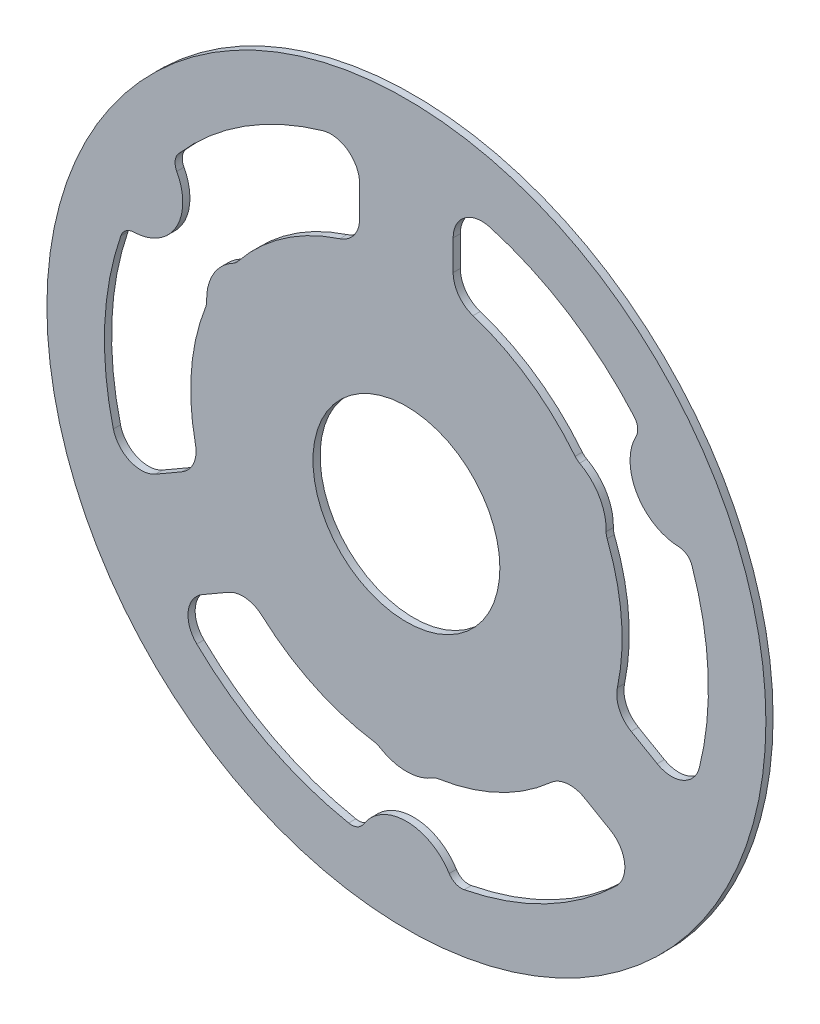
from build123d import *

# Parameters (mm, degrees)
ESQUISSE1_R          = 25
ESQUISSE1_R_2        = 6.5
BASE_EXTRUSION_DEPTH = 0.5


with BuildPart() as part:
    # Esquisse1 → Base-Extrusion (new body)
    with BuildSketch(Plane.XY):
        Circle(ESQUISSE1_R)
        Circle(ESQUISSE1_R_2, mode=Mode.SUBTRACT)
        with BuildLine():
            Line((15.627789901, -5.269931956), (17.438858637, -6.315552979))
            ThreePointArc((17.438858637, -6.315552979), (19.22097058, -6.424235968), (20.379791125, -5.065976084))
            ThreePointArc((20.379791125, -5.065976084), (20.979912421, 0.918299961), (19.85921918, 6.8272552))
            ThreePointArc((19.85921918, 6.8272552), (19.506948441, 7.307050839), (18.9444347, 7.501670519))
            ThreePointArc((18.9444347, 7.501670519), (16.02146997, 9.25), (15.96885459, 12.655526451))
            ThreePointArc((15.96885459, 12.655526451), (16.081565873, 13.239987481), (15.842186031, 13.784960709))
            ThreePointArc((15.842186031, 13.784960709), (11.285227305, 17.709987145), (5.802631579, 20.18240488))
            ThreePointArc((5.802631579, 20.18240488), (4.046933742, 19.857966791), (3.25, 18.260271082))
            Line((3.25, 18.260271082), (3.25, 16.169029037))
            ThreePointArc((3.25, 16.169029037), (3.632085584, 14.993293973), (4.632352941, 14.266790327))
            ThreePointArc((4.632352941, 14.266790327), (8.545219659, 12.327985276), (11.73385087, 9.344342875))
            ThreePointArc((11.73385087, 9.344342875), (11.875803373, 9.199177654), (12.044151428, 9.085677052))
            ThreePointArc((12.044151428, 9.085677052), (13.423393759, 7.75), (13.890502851, 5.887702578))
            ThreePointArc((13.890502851, 5.887702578), (13.904623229, 5.685158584), (13.959363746, 5.4896415))
            ThreePointArc((13.959363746, 5.4896415), (14.948958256, 1.236384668), (14.671579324, -3.121659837))
            ThreePointArc((14.671579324, -3.121659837), (14.800616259, -4.351168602), (15.627789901, -5.269931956))
        make_face(mode=Mode.SUBTRACT)
        with BuildLine():
            Line((-12.377789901, -10.899097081), (-14.188858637, -11.944718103))
            ThreePointArc((-14.188858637, -11.944718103), (-15.174036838, -13.433730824), (-14.577159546, -15.116428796))
            ThreePointArc((-14.577159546, -15.116428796), (-9.694685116, -18.628287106), (-4.017033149, -20.612215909))
            ThreePointArc((-4.017033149, -20.612215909), (-3.425382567, -20.547038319), (-2.97558011, -20.15719697))
            ThreePointArc((-2.97558011, -20.15719697), (0, -18.5), (2.97558011, -20.15719697))
            ThreePointArc((2.97558011, -20.15719697), (3.425382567, -20.547038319), (4.017033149, -20.612215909))
            ThreePointArc((4.017033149, -20.612215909), (9.694685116, -18.628287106), (14.577159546, -15.116428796))
            ThreePointArc((14.577159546, -15.116428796), (15.174036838, -13.433730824), (14.188858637, -11.944718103))
            Line((14.188858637, -11.944718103), (12.377789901, -10.899097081))
            ThreePointArc((12.377789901, -10.899097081), (11.168530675, -10.642125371), (10.039226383, -11.14513049))
            ThreePointArc((10.039226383, -11.14513049), (6.403738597, -13.564369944), (2.225512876, -14.833984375))
            ThreePointArc((2.225512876, -14.833984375), (2.028819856, -14.884336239), (1.846351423, -14.97337963))
            ThreePointArc((1.846351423, -14.97337963), (0, -15.5), (-1.846351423, -14.97337963))
            ThreePointArc((-1.846351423, -14.97337963), (-2.028819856, -14.884336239), (-2.225512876, -14.833984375))
            ThreePointArc((-2.225512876, -14.833984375), (-6.403738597, -13.564369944), (-10.039226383, -11.14513049))
            ThreePointArc((-10.039226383, -11.14513049), (-11.168530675, -10.642125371), (-12.377789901, -10.899097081))
        make_face(mode=Mode.SUBTRACT)
        with BuildLine():
            Line((-3.25, 16.169029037), (-3.25, 18.260271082))
            ThreePointArc((-3.25, 18.260271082), (-4.046933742, 19.857966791), (-5.802631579, 20.18240488))
            ThreePointArc((-5.802631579, 20.18240488), (-11.285227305, 17.709987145), (-15.842186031, 13.784960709))
            ThreePointArc((-15.842186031, 13.784960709), (-16.081565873, 13.239987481), (-15.96885459, 12.655526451))
            ThreePointArc((-15.96885459, 12.655526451), (-16.02146997, 9.25), (-18.9444347, 7.501670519))
            ThreePointArc((-18.9444347, 7.501670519), (-19.506948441, 7.307050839), (-19.85921918, 6.8272552))
            ThreePointArc((-19.85921918, 6.8272552), (-20.979912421, 0.918299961), (-20.379791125, -5.065976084))
            ThreePointArc((-20.379791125, -5.065976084), (-19.22097058, -6.424235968), (-17.438858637, -6.315552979))
            Line((-17.438858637, -6.315552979), (-15.627789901, -5.269931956))
            ThreePointArc((-15.627789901, -5.269931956), (-14.800616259, -4.351168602), (-14.671579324, -3.121659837))
            ThreePointArc((-14.671579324, -3.121659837), (-14.948958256, 1.236384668), (-13.959363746, 5.4896415))
            ThreePointArc((-13.959363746, 5.4896415), (-13.904623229, 5.685158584), (-13.890502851, 5.887702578))
            ThreePointArc((-13.890502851, 5.887702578), (-13.423393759, 7.75), (-12.044151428, 9.085677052))
            ThreePointArc((-12.044151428, 9.085677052), (-11.875803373, 9.199177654), (-11.73385087, 9.344342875))
            ThreePointArc((-11.73385087, 9.344342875), (-8.545219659, 12.327985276), (-4.632352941, 14.266790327))
            ThreePointArc((-4.632352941, 14.266790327), (-3.632085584, 14.993293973), (-3.25, 16.169029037))
        make_face(mode=Mode.SUBTRACT)
    extrude(amount=BASE_EXTRUSION_DEPTH)


solid = part.part
